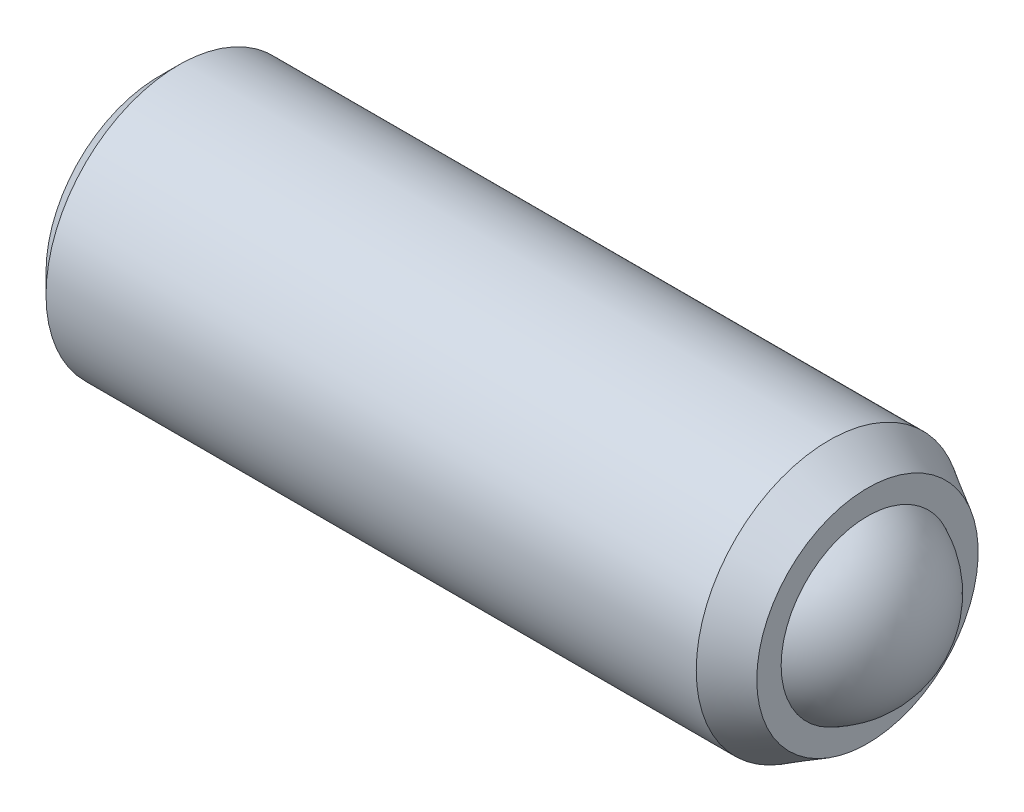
ISO-10303-21;
HEADER;
FILE_DESCRIPTION(('STEP AP214'),'2;1');
FILE_NAME('part.step','',(''),(''),'','','');
FILE_SCHEMA(('AUTOMOTIVE_DESIGN { 1 0 10303 214 1 1 1 1 }'));
ENDSEC;
DATA;
#1=APPLICATION_CONTEXT('core data for automotive mechanical design processes');
#2=APPLICATION_PROTOCOL_DEFINITION('international standard','automotive_design',2000,#1);
#3=PRODUCT_CONTEXT('',#1,'mechanical');
#4=PRODUCT('Part','Part','',(#3));
#5=PRODUCT_RELATED_PRODUCT_CATEGORY('part','',(#4));
#6=PRODUCT_DEFINITION_FORMATION('','',#4);
#7=PRODUCT_DEFINITION_CONTEXT('part definition',#1,'design');
#8=PRODUCT_DEFINITION('design','',#6,#7);
#9=PRODUCT_DEFINITION_SHAPE('','',#8);
#10=(LENGTH_UNIT() NAMED_UNIT(*) SI_UNIT(.MILLI.,.METRE.));
#11=(NAMED_UNIT(*) PLANE_ANGLE_UNIT() SI_UNIT($,.RADIAN.));
#12=(NAMED_UNIT(*) SI_UNIT($,.STERADIAN.) SOLID_ANGLE_UNIT());
#13=UNCERTAINTY_MEASURE_WITH_UNIT(LENGTH_MEASURE(1.E-05),#10,'distance_accuracy_value','');
#14=(GEOMETRIC_REPRESENTATION_CONTEXT(3) GLOBAL_UNCERTAINTY_ASSIGNED_CONTEXT((#13)) GLOBAL_UNIT_ASSIGNED_CONTEXT((#10,
#11,#12)) REPRESENTATION_CONTEXT('',''));
#15=CARTESIAN_POINT('',(0.,0.,0.));
#16=DIRECTION('',(0.,0.,1.));
#17=DIRECTION('',(1.,0.,0.));
#18=AXIS2_PLACEMENT_3D('',#15,#16,#17);
#19=CARTESIAN_POINT('',(11.35,0.,0.));
#20=DIRECTION('',(0.,-1.,0.));
#21=DIRECTION('',(-1.,0.,0.));
#22=AXIS2_PLACEMENT_3D('',#19,#20,#21);
#23=SPHERICAL_SURFACE('',#22,1.6);
#24=CARTESIAN_POINT('',(11.35,-1.6,0.));
#25=VERTEX_POINT('',#24);
#26=VERTEX_LOOP('',#25);
#27=FACE_BOUND('',#26,.T.);
#28=ADVANCED_FACE('P0_F11',(#27),#23,.T.);
#29=CLOSED_SHELL('',(#28));
#30=MANIFOLD_SOLID_BREP('P0_B1',#29);
#31=CARTESIAN_POINT('',(0.,0.,0.));
#32=DIRECTION('',(1.,0.,0.));
#33=DIRECTION('',(0.,0.,-1.));
#34=AXIS2_PLACEMENT_3D('',#31,#32,#33);
#35=PLANE('',#34);
#36=CARTESIAN_POINT('',(0.,0.,0.));
#37=DIRECTION('',(-1.,0.,0.));
#38=DIRECTION('',(0.,0.,1.));
#39=AXIS2_PLACEMENT_3D('',#36,#37,#38);
#40=CIRCLE('',#39,1.9125);
#41=CARTESIAN_POINT('',(0.,0.,1.9125));
#42=VERTEX_POINT('',#41);
#43=EDGE_CURVE('P1_E10',#42,#42,#40,.T.);
#44=ORIENTED_EDGE('',*,*,#43,.T.);
#45=EDGE_LOOP('',(#44));
#46=FACE_BOUND('',#45,.T.);
#47=ADVANCED_FACE('P1_F15',(#46),#35,.F.);
#48=CARTESIAN_POINT('',(0.3375,0.,0.));
#49=DIRECTION('',(1.,0.,0.));
#50=DIRECTION('',(0.,0.,-1.));
#51=AXIS2_PLACEMENT_3D('',#48,#49,#50);
#52=CONICAL_SURFACE('',#51,2.25,0.785398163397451);
#53=ORIENTED_EDGE('',*,*,#43,.F.);
#54=EDGE_LOOP('',(#53));
#55=FACE_BOUND('',#54,.T.);
#56=CARTESIAN_POINT('',(0.3375,0.,0.));
#57=DIRECTION('',(-1.,0.,0.));
#58=DIRECTION('',(0.,0.,1.));
#59=AXIS2_PLACEMENT_3D('',#56,#57,#58);
#60=CIRCLE('',#59,2.25);
#61=CARTESIAN_POINT('',(0.3375,0.,2.25));
#62=VERTEX_POINT('',#61);
#63=EDGE_CURVE('P1_E21',#62,#62,#60,.T.);
#64=ORIENTED_EDGE('',*,*,#63,.T.);
#65=EDGE_LOOP('',(#64));
#66=FACE_BOUND('',#65,.T.);
#67=ADVANCED_FACE('P1_F39',(#55,#66),#52,.T.);
#68=CARTESIAN_POINT('',(0.,0.,0.));
#69=DIRECTION('',(-1.,0.,0.));
#70=DIRECTION('',(0.,0.,1.));
#71=AXIS2_PLACEMENT_3D('',#68,#69,#70);
#72=CYLINDRICAL_SURFACE('',#71,2.25);
#73=ORIENTED_EDGE('',*,*,#63,.F.);
#74=EDGE_LOOP('',(#73));
#75=FACE_BOUND('',#74,.T.);
#76=CARTESIAN_POINT('',(11.35,0.,0.));
#77=DIRECTION('',(-1.,0.,0.));
#78=DIRECTION('',(0.,0.,1.));
#79=AXIS2_PLACEMENT_3D('',#76,#77,#78);
#80=CIRCLE('',#79,2.25);
#81=CARTESIAN_POINT('',(11.35,0.,2.25));
#82=VERTEX_POINT('',#81);
#83=EDGE_CURVE('P1_E52',#82,#82,#80,.T.);
#84=ORIENTED_EDGE('',*,*,#83,.T.);
#85=EDGE_LOOP('',(#84));
#86=FACE_BOUND('',#85,.T.);
#87=ADVANCED_FACE('P1_F45',(#75,#86),#72,.T.);
#88=CARTESIAN_POINT('',(12.,0.,0.));
#89=DIRECTION('',(-1.,0.,0.));
#90=DIRECTION('',(0.,0.,1.));
#91=AXIS2_PLACEMENT_3D('',#88,#89,#90);
#92=CONICAL_SURFACE('',#91,1.87472232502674,0.523598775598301);
#93=ORIENTED_EDGE('',*,*,#83,.F.);
#94=EDGE_LOOP('',(#93));
#95=FACE_BOUND('',#94,.T.);
#96=CARTESIAN_POINT('',(12.,0.,0.));
#97=DIRECTION('',(-1.,0.,0.));
#98=DIRECTION('',(0.,0.,1.));
#99=AXIS2_PLACEMENT_3D('',#96,#97,#98);
#100=CIRCLE('',#99,1.87472232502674);
#101=CARTESIAN_POINT('',(12.,0.,1.87472232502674));
#102=VERTEX_POINT('',#101);
#103=EDGE_CURVE('P1_E54',#102,#102,#100,.T.);
#104=ORIENTED_EDGE('',*,*,#103,.T.);
#105=EDGE_LOOP('',(#104));
#106=FACE_BOUND('',#105,.T.);
#107=ADVANCED_FACE('P1_F78',(#95,#106),#92,.T.);
#108=CARTESIAN_POINT('',(12.,1.87472232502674,0.));
#109=DIRECTION('',(-1.,0.,0.));
#110=DIRECTION('',(0.,0.,1.));
#111=AXIS2_PLACEMENT_3D('',#108,#109,#110);
#112=PLANE('',#111);
#113=ORIENTED_EDGE('',*,*,#103,.F.);
#114=EDGE_LOOP('',(#113));
#115=FACE_BOUND('',#114,.T.);
#116=CARTESIAN_POINT('',(12.,0.,0.));
#117=DIRECTION('',(-1.,0.,0.));
#118=DIRECTION('',(0.,0.,1.));
#119=AXIS2_PLACEMENT_3D('',#116,#117,#118);
#120=CIRCLE('',#119,1.46201915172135);
#121=CARTESIAN_POINT('',(12.,0.,1.46201915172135));
#122=VERTEX_POINT('',#121);
#123=EDGE_CURVE('P1_E59',#122,#122,#120,.T.);
#124=ORIENTED_EDGE('',*,*,#123,.T.);
#125=EDGE_LOOP('',(#124));
#126=FACE_BOUND('',#125,.T.);
#127=ADVANCED_FACE('P1_F71',(#115,#126),#112,.F.);
#128=CARTESIAN_POINT('',(11.35,0.,0.));
#129=DIRECTION('',(-1.,0.,0.));
#130=DIRECTION('',(0.,1.,0.));
#131=AXIS2_PLACEMENT_3D('',#128,#129,#130);
#132=SPHERICAL_SURFACE('',#131,1.6);
#133=ORIENTED_EDGE('',*,*,#123,.F.);
#134=EDGE_LOOP('',(#133));
#135=FACE_BOUND('',#134,.T.);
#136=CARTESIAN_POINT('',(11.35,0.,0.));
#137=DIRECTION('',(-1.,0.,0.));
#138=DIRECTION('',(0.,0.,1.));
#139=AXIS2_PLACEMENT_3D('',#136,#137,#138);
#140=CIRCLE('',#139,1.6);
#141=CARTESIAN_POINT('',(11.35,0.,1.6));
#142=VERTEX_POINT('',#141);
#143=EDGE_CURVE('P1_E62',#142,#142,#140,.T.);
#144=ORIENTED_EDGE('',*,*,#143,.T.);
#145=EDGE_LOOP('',(#144));
#146=FACE_BOUND('',#145,.T.);
#147=ADVANCED_FACE('P1_F34',(#135,#146),#132,.F.);
#148=CARTESIAN_POINT('',(0.,0.,0.));
#149=DIRECTION('',(-1.,0.,0.));
#150=DIRECTION('',(0.,0.,1.));
#151=AXIS2_PLACEMENT_3D('',#148,#149,#150);
#152=CYLINDRICAL_SURFACE('',#151,1.6);
#153=ORIENTED_EDGE('',*,*,#143,.F.);
#154=EDGE_LOOP('',(#153));
#155=FACE_BOUND('',#154,.T.);
#156=CARTESIAN_POINT('',(2.3737604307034,0.,0.));
#157=DIRECTION('',(-1.,0.,0.));
#158=DIRECTION('',(0.,0.,1.));
#159=AXIS2_PLACEMENT_3D('',#156,#157,#158);
#160=CIRCLE('',#159,1.6);
#161=CARTESIAN_POINT('',(2.3737604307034,0.,1.6));
#162=VERTEX_POINT('',#161);
#163=EDGE_CURVE('P1_E65',#162,#162,#160,.T.);
#164=ORIENTED_EDGE('',*,*,#163,.T.);
#165=EDGE_LOOP('',(#164));
#166=FACE_BOUND('',#165,.T.);
#167=ADVANCED_FACE('P1_F26',(#155,#166),#152,.F.);
#168=CARTESIAN_POINT('',(1.45,0.,0.));
#169=DIRECTION('',(1.,0.,0.));
#170=DIRECTION('',(0.,0.,-1.));
#171=AXIS2_PLACEMENT_3D('',#168,#169,#170);
#172=CONICAL_SURFACE('',#171,0.,1.0471975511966);
#173=ORIENTED_EDGE('',*,*,#163,.F.);
#174=EDGE_LOOP('',(#173));
#175=FACE_BOUND('',#174,.T.);
#176=CARTESIAN_POINT('',(1.45,0.,0.));
#177=VERTEX_POINT('',#176);
#178=VERTEX_LOOP('',#177);
#179=FACE_BOUND('',#178,.T.);
#180=ADVANCED_FACE('P1_F24',(#175,#179),#172,.F.);
#181=CLOSED_SHELL('',(#47,#67,#87,#107,#127,#147,#167,#180));
#182=MANIFOLD_SOLID_BREP('P1_B1',#181);
#183=ADVANCED_BREP_SHAPE_REPRESENTATION('',(#18,#30,#182),#14);
#184=SHAPE_DEFINITION_REPRESENTATION(#9,#183);
ENDSEC;
END-ISO-10303-21;
